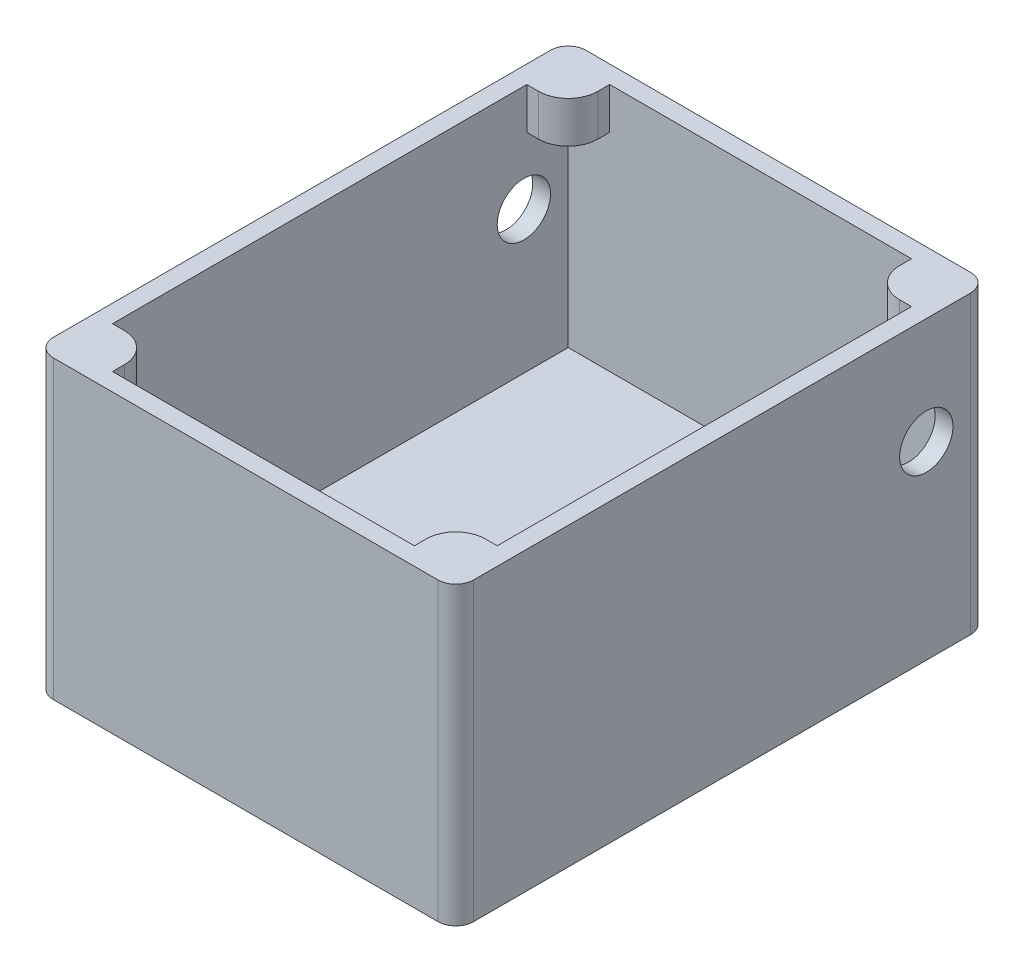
ISO-10303-21;
HEADER;
FILE_DESCRIPTION(('STEP AP214'),'2;1');
FILE_NAME('part.step','',(''),(''),'','','');
FILE_SCHEMA(('AUTOMOTIVE_DESIGN { 1 0 10303 214 1 1 1 1 }'));
ENDSEC;
DATA;
#1=APPLICATION_CONTEXT('core data for automotive mechanical design processes');
#2=APPLICATION_PROTOCOL_DEFINITION('international standard','automotive_design',2000,#1);
#3=PRODUCT_CONTEXT('',#1,'mechanical');
#4=PRODUCT('Part','Part','',(#3));
#5=PRODUCT_RELATED_PRODUCT_CATEGORY('part','',(#4));
#6=PRODUCT_DEFINITION_FORMATION('','',#4);
#7=PRODUCT_DEFINITION_CONTEXT('part definition',#1,'design');
#8=PRODUCT_DEFINITION('design','',#6,#7);
#9=PRODUCT_DEFINITION_SHAPE('','',#8);
#10=(LENGTH_UNIT() NAMED_UNIT(*) SI_UNIT(.MILLI.,.METRE.));
#11=(NAMED_UNIT(*) PLANE_ANGLE_UNIT() SI_UNIT($,.RADIAN.));
#12=(NAMED_UNIT(*) SI_UNIT($,.STERADIAN.) SOLID_ANGLE_UNIT());
#13=UNCERTAINTY_MEASURE_WITH_UNIT(LENGTH_MEASURE(1.E-05),#10,'distance_accuracy_value','');
#14=(GEOMETRIC_REPRESENTATION_CONTEXT(3) GLOBAL_UNCERTAINTY_ASSIGNED_CONTEXT((#13)) GLOBAL_UNIT_ASSIGNED_CONTEXT((#10,
#11,#12)) REPRESENTATION_CONTEXT('',''));
#15=CARTESIAN_POINT('',(0.,0.,0.));
#16=DIRECTION('',(0.,0.,1.));
#17=DIRECTION('',(1.,0.,0.));
#18=AXIS2_PLACEMENT_3D('',#15,#16,#17);
#19=CARTESIAN_POINT('',(1.30383104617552,43.,55.499999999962));
#20=DIRECTION('',(0.,-1.,0.));
#21=DIRECTION('',(0.,0.,-1.));
#22=AXIS2_PLACEMENT_3D('',#19,#20,#21);
#23=CYLINDRICAL_SURFACE('',#22,5.);
#24=DIRECTION('',(0.,-1.,0.));
#25=VECTOR('',#24,1.);
#26=CARTESIAN_POINT('',(-3.69616895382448,43.,55.499999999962));
#27=LINE('',#26,#25);
#28=CARTESIAN_POINT('',(-3.69616895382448,50.,55.499999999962));
#29=VERTEX_POINT('',#28);
#30=CARTESIAN_POINT('',(-3.69616895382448,43.,55.499999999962));
#31=VERTEX_POINT('',#30);
#32=EDGE_CURVE('E459',#29,#31,#27,.T.);
#33=ORIENTED_EDGE('',*,*,#32,.F.);
#34=CARTESIAN_POINT('',(1.30383104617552,50.,55.499999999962));
#35=DIRECTION('',(0.,-1.,0.));
#36=DIRECTION('',(0.,0.,-1.));
#37=AXIS2_PLACEMENT_3D('',#34,#35,#36);
#38=CIRCLE('',#37,5.);
#39=CARTESIAN_POINT('',(1.30383104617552,50.,50.499999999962));
#40=VERTEX_POINT('',#39);
#41=EDGE_CURVE('E40',#40,#29,#38,.F.);
#42=ORIENTED_EDGE('',*,*,#41,.F.);
#43=DIRECTION('',(0.,-1.,0.));
#44=VECTOR('',#43,1.);
#45=CARTESIAN_POINT('',(1.30383104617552,43.,50.499999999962));
#46=LINE('',#45,#44);
#47=CARTESIAN_POINT('',(1.30383104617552,43.,50.499999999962));
#48=VERTEX_POINT('',#47);
#49=EDGE_CURVE('E258',#48,#40,#46,.F.);
#50=ORIENTED_EDGE('',*,*,#49,.F.);
#51=CARTESIAN_POINT('',(1.30383104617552,43.,55.499999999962));
#52=DIRECTION('',(0.,1.,0.));
#53=DIRECTION('',(0.,0.,1.));
#54=AXIS2_PLACEMENT_3D('',#51,#52,#53);
#55=CIRCLE('',#54,5.);
#56=EDGE_CURVE('E11',#31,#48,#55,.F.);
#57=ORIENTED_EDGE('',*,*,#56,.F.);
#58=EDGE_LOOP('',(#33,#42,#50,#57));
#59=FACE_BOUND('',#58,.T.);
#60=ADVANCED_FACE('F33',(#59),#23,.T.);
#61=CARTESIAN_POINT('',(-59.6961689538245,43.,55.499999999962));
#62=DIRECTION('',(0.,1.,0.));
#63=DIRECTION('',(0.,0.,1.));
#64=AXIS2_PLACEMENT_3D('',#61,#62,#63);
#65=CYLINDRICAL_SURFACE('',#64,5.);
#66=DIRECTION('',(0.,1.,0.));
#67=VECTOR('',#66,1.);
#68=CARTESIAN_POINT('',(-54.6961689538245,43.,55.499999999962));
#69=LINE('',#68,#67);
#70=CARTESIAN_POINT('',(-54.6961689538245,43.,55.499999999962));
#71=VERTEX_POINT('',#70);
#72=CARTESIAN_POINT('',(-54.6961689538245,50.,55.499999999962));
#73=VERTEX_POINT('',#72);
#74=EDGE_CURVE('E449',#71,#73,#69,.T.);
#75=ORIENTED_EDGE('',*,*,#74,.F.);
#76=CARTESIAN_POINT('',(-59.6961689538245,43.,55.499999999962));
#77=DIRECTION('',(0.,-1.,0.));
#78=DIRECTION('',(0.,0.,-1.));
#79=AXIS2_PLACEMENT_3D('',#76,#77,#78);
#80=CIRCLE('',#79,5.);
#81=CARTESIAN_POINT('',(-59.6961689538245,43.,50.499999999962));
#82=VERTEX_POINT('',#81);
#83=EDGE_CURVE('E455',#82,#71,#80,.T.);
#84=ORIENTED_EDGE('',*,*,#83,.F.);
#85=DIRECTION('',(0.,1.,0.));
#86=VECTOR('',#85,1.);
#87=CARTESIAN_POINT('',(-59.6961689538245,43.,50.499999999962));
#88=LINE('',#87,#86);
#89=CARTESIAN_POINT('',(-59.6961689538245,50.,50.499999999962));
#90=VERTEX_POINT('',#89);
#91=EDGE_CURVE('E452',#90,#82,#88,.F.);
#92=ORIENTED_EDGE('',*,*,#91,.F.);
#93=CARTESIAN_POINT('',(-59.6961689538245,50.,55.499999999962));
#94=DIRECTION('',(0.,-1.,0.));
#95=DIRECTION('',(0.,0.,-1.));
#96=AXIS2_PLACEMENT_3D('',#93,#94,#95);
#97=CIRCLE('',#96,5.);
#98=EDGE_CURVE('E457',#73,#90,#97,.F.);
#99=ORIENTED_EDGE('',*,*,#98,.F.);
#100=EDGE_LOOP('',(#75,#84,#92,#99));
#101=FACE_BOUND('',#100,.T.);
#102=ADVANCED_FACE('F559',(#101),#65,.T.);
#103=CARTESIAN_POINT('',(1.30383104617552,43.,-24.5));
#104=DIRECTION('',(0.,1.,0.));
#105=DIRECTION('',(0.,0.,1.));
#106=AXIS2_PLACEMENT_3D('',#103,#104,#105);
#107=CYLINDRICAL_SURFACE('',#106,5.);
#108=DIRECTION('',(0.,1.,0.));
#109=VECTOR('',#108,1.);
#110=CARTESIAN_POINT('',(-3.69616895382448,43.,-24.5));
#111=LINE('',#110,#109);
#112=CARTESIAN_POINT('',(-3.69616895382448,43.,-24.5));
#113=VERTEX_POINT('',#112);
#114=CARTESIAN_POINT('',(-3.69616895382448,50.,-24.5));
#115=VERTEX_POINT('',#114);
#116=EDGE_CURVE('E439',#113,#115,#111,.T.);
#117=ORIENTED_EDGE('',*,*,#116,.F.);
#118=CARTESIAN_POINT('',(1.30383104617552,43.,-24.5));
#119=DIRECTION('',(0.,-1.,0.));
#120=DIRECTION('',(0.,0.,-1.));
#121=AXIS2_PLACEMENT_3D('',#118,#119,#120);
#122=CIRCLE('',#121,5.);
#123=CARTESIAN_POINT('',(1.30383104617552,43.,-19.5));
#124=VERTEX_POINT('',#123);
#125=EDGE_CURVE('E445',#124,#113,#122,.T.);
#126=ORIENTED_EDGE('',*,*,#125,.F.);
#127=DIRECTION('',(0.,1.,0.));
#128=VECTOR('',#127,1.);
#129=CARTESIAN_POINT('',(1.30383104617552,43.,-19.5));
#130=LINE('',#129,#128);
#131=CARTESIAN_POINT('',(1.30383104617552,50.,-19.5));
#132=VERTEX_POINT('',#131);
#133=EDGE_CURVE('E442',#132,#124,#130,.F.);
#134=ORIENTED_EDGE('',*,*,#133,.F.);
#135=CARTESIAN_POINT('',(1.30383104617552,50.,-24.5));
#136=DIRECTION('',(0.,-1.,0.));
#137=DIRECTION('',(0.,0.,-1.));
#138=AXIS2_PLACEMENT_3D('',#135,#136,#137);
#139=CIRCLE('',#138,5.);
#140=EDGE_CURVE('E447',#115,#132,#139,.F.);
#141=ORIENTED_EDGE('',*,*,#140,.F.);
#142=EDGE_LOOP('',(#117,#126,#134,#141));
#143=FACE_BOUND('',#142,.T.);
#144=ADVANCED_FACE('F563',(#143),#107,.T.);
#145=CARTESIAN_POINT('',(-59.6961689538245,43.,-24.5));
#146=DIRECTION('',(0.,1.,0.));
#147=DIRECTION('',(0.,0.,1.));
#148=AXIS2_PLACEMENT_3D('',#145,#146,#147);
#149=CYLINDRICAL_SURFACE('',#148,5.);
#150=DIRECTION('',(0.,1.,0.));
#151=VECTOR('',#150,1.);
#152=CARTESIAN_POINT('',(-59.6961689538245,43.,-19.5));
#153=LINE('',#152,#151);
#154=CARTESIAN_POINT('',(-59.6961689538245,43.,-19.5));
#155=VERTEX_POINT('',#154);
#156=CARTESIAN_POINT('',(-59.6961689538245,50.,-19.5));
#157=VERTEX_POINT('',#156);
#158=EDGE_CURVE('E429',#155,#157,#153,.T.);
#159=ORIENTED_EDGE('',*,*,#158,.F.);
#160=CARTESIAN_POINT('',(-59.6961689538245,43.,-24.5));
#161=DIRECTION('',(0.,1.,0.));
#162=DIRECTION('',(0.,0.,1.));
#163=AXIS2_PLACEMENT_3D('',#160,#161,#162);
#164=CIRCLE('',#163,5.);
#165=CARTESIAN_POINT('',(-54.6961689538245,43.,-24.5));
#166=VERTEX_POINT('',#165);
#167=EDGE_CURVE('E435',#166,#155,#164,.F.);
#168=ORIENTED_EDGE('',*,*,#167,.F.);
#169=DIRECTION('',(0.,1.,0.));
#170=VECTOR('',#169,1.);
#171=CARTESIAN_POINT('',(-54.6961689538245,43.,-24.5));
#172=LINE('',#171,#170);
#173=CARTESIAN_POINT('',(-54.6961689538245,50.,-24.5));
#174=VERTEX_POINT('',#173);
#175=EDGE_CURVE('E432',#174,#166,#172,.F.);
#176=ORIENTED_EDGE('',*,*,#175,.F.);
#177=CARTESIAN_POINT('',(-59.6961689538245,50.,-24.5));
#178=DIRECTION('',(0.,-1.,0.));
#179=DIRECTION('',(0.,0.,-1.));
#180=AXIS2_PLACEMENT_3D('',#177,#178,#179);
#181=CIRCLE('',#180,5.);
#182=EDGE_CURVE('E437',#157,#174,#181,.F.);
#183=ORIENTED_EDGE('',*,*,#182,.F.);
#184=EDGE_LOOP('',(#159,#168,#176,#183));
#185=FACE_BOUND('',#184,.T.);
#186=ADVANCED_FACE('F511',(#185),#149,.T.);
#187=CARTESIAN_POINT('',(-61.6961689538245,50.,57.499999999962));
#188=DIRECTION('',(0.,1.,0.));
#189=DIRECTION('',(0.,0.,1.));
#190=AXIS2_PLACEMENT_3D('',#187,#188,#189);
#191=CYLINDRICAL_SURFACE('',#190,3.);
#192=DIRECTION('',(0.,1.,0.));
#193=VECTOR('',#192,1.);
#194=CARTESIAN_POINT('',(-64.6961689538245,50.,57.499999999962));
#195=LINE('',#194,#193);
#196=CARTESIAN_POINT('',(-64.6961689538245,0.,57.499999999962));
#197=VERTEX_POINT('',#196);
#198=CARTESIAN_POINT('',(-64.6961689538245,50.,57.499999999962));
#199=VERTEX_POINT('',#198);
#200=EDGE_CURVE('E419',#197,#199,#195,.T.);
#201=ORIENTED_EDGE('',*,*,#200,.F.);
#202=CARTESIAN_POINT('',(-61.6961689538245,0.,57.499999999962));
#203=DIRECTION('',(0.,-1.,0.));
#204=DIRECTION('',(0.,0.,-1.));
#205=AXIS2_PLACEMENT_3D('',#202,#203,#204);
#206=CIRCLE('',#205,3.);
#207=CARTESIAN_POINT('',(-61.6961689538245,0.,60.499999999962));
#208=VERTEX_POINT('',#207);
#209=EDGE_CURVE('E425',#208,#197,#206,.T.);
#210=ORIENTED_EDGE('',*,*,#209,.F.);
#211=DIRECTION('',(0.,1.,0.));
#212=VECTOR('',#211,1.);
#213=CARTESIAN_POINT('',(-61.6961689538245,50.,60.499999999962));
#214=LINE('',#213,#212);
#215=CARTESIAN_POINT('',(-61.6961689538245,50.,60.499999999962));
#216=VERTEX_POINT('',#215);
#217=EDGE_CURVE('E422',#216,#208,#214,.F.);
#218=ORIENTED_EDGE('',*,*,#217,.F.);
#219=CARTESIAN_POINT('',(-61.6961689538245,50.,57.499999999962));
#220=DIRECTION('',(0.,-1.,0.));
#221=DIRECTION('',(0.,0.,-1.));
#222=AXIS2_PLACEMENT_3D('',#219,#220,#221);
#223=CIRCLE('',#222,3.);
#224=EDGE_CURVE('E427',#199,#216,#223,.F.);
#225=ORIENTED_EDGE('',*,*,#224,.F.);
#226=EDGE_LOOP('',(#201,#210,#218,#225));
#227=FACE_BOUND('',#226,.T.);
#228=ADVANCED_FACE('F573',(#227),#191,.T.);
#229=CARTESIAN_POINT('',(3.30383104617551,50.,57.499999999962));
#230=DIRECTION('',(0.,-1.,0.));
#231=DIRECTION('',(0.,0.,-1.));
#232=AXIS2_PLACEMENT_3D('',#229,#230,#231);
#233=CYLINDRICAL_SURFACE('',#232,3.);
#234=DIRECTION('',(0.,1.,0.));
#235=VECTOR('',#234,1.);
#236=CARTESIAN_POINT('',(3.30383104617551,50.,60.499999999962));
#237=LINE('',#236,#235);
#238=CARTESIAN_POINT('',(3.30383104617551,0.,60.499999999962));
#239=VERTEX_POINT('',#238);
#240=CARTESIAN_POINT('',(3.30383104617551,50.,60.499999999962));
#241=VERTEX_POINT('',#240);
#242=EDGE_CURVE('E408',#239,#241,#237,.T.);
#243=ORIENTED_EDGE('',*,*,#242,.F.);
#244=CARTESIAN_POINT('',(3.30383104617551,0.,57.499999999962));
#245=DIRECTION('',(0.,-1.,0.));
#246=DIRECTION('',(0.,0.,-1.));
#247=AXIS2_PLACEMENT_3D('',#244,#245,#246);
#248=CIRCLE('',#247,3.);
#249=CARTESIAN_POINT('',(6.30383104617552,0.,57.499999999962));
#250=VERTEX_POINT('',#249);
#251=EDGE_CURVE('E414',#250,#239,#248,.T.);
#252=ORIENTED_EDGE('',*,*,#251,.F.);
#253=DIRECTION('',(0.,1.,0.));
#254=VECTOR('',#253,1.);
#255=CARTESIAN_POINT('',(6.30383104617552,50.,57.499999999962));
#256=LINE('',#255,#254);
#257=CARTESIAN_POINT('',(6.30383104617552,50.,57.499999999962));
#258=VERTEX_POINT('',#257);
#259=EDGE_CURVE('E411',#258,#250,#256,.F.);
#260=ORIENTED_EDGE('',*,*,#259,.F.);
#261=CARTESIAN_POINT('',(3.30383104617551,50.,57.499999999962));
#262=DIRECTION('',(0.,-1.,0.));
#263=DIRECTION('',(0.,0.,-1.));
#264=AXIS2_PLACEMENT_3D('',#261,#262,#263);
#265=CIRCLE('',#264,3.);
#266=EDGE_CURVE('E417',#241,#258,#265,.F.);
#267=ORIENTED_EDGE('',*,*,#266,.F.);
#268=EDGE_LOOP('',(#243,#252,#260,#267));
#269=FACE_BOUND('',#268,.T.);
#270=ADVANCED_FACE('F576',(#269),#233,.T.);
#271=CARTESIAN_POINT('',(3.30383104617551,50.,-26.5));
#272=DIRECTION('',(0.,1.,0.));
#273=DIRECTION('',(0.,0.,1.));
#274=AXIS2_PLACEMENT_3D('',#271,#272,#273);
#275=CYLINDRICAL_SURFACE('',#274,3.);
#276=DIRECTION('',(0.,1.,0.));
#277=VECTOR('',#276,1.);
#278=CARTESIAN_POINT('',(6.30383104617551,50.,-26.5));
#279=LINE('',#278,#277);
#280=CARTESIAN_POINT('',(6.30383104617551,0.,-26.5));
#281=VERTEX_POINT('',#280);
#282=CARTESIAN_POINT('',(6.30383104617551,50.,-26.5));
#283=VERTEX_POINT('',#282);
#284=EDGE_CURVE('E398',#281,#283,#279,.T.);
#285=ORIENTED_EDGE('',*,*,#284,.F.);
#286=CARTESIAN_POINT('',(3.30383104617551,0.,-26.5));
#287=DIRECTION('',(0.,-1.,0.));
#288=DIRECTION('',(0.,0.,-1.));
#289=AXIS2_PLACEMENT_3D('',#286,#287,#288);
#290=CIRCLE('',#289,3.);
#291=CARTESIAN_POINT('',(3.30383104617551,0.,-29.5));
#292=VERTEX_POINT('',#291);
#293=EDGE_CURVE('E404',#292,#281,#290,.T.);
#294=ORIENTED_EDGE('',*,*,#293,.F.);
#295=DIRECTION('',(0.,1.,0.));
#296=VECTOR('',#295,1.);
#297=CARTESIAN_POINT('',(3.30383104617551,50.,-29.5));
#298=LINE('',#297,#296);
#299=CARTESIAN_POINT('',(3.30383104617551,50.,-29.5));
#300=VERTEX_POINT('',#299);
#301=EDGE_CURVE('E401',#300,#292,#298,.F.);
#302=ORIENTED_EDGE('',*,*,#301,.F.);
#303=CARTESIAN_POINT('',(3.30383104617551,50.,-26.5));
#304=DIRECTION('',(0.,-1.,0.));
#305=DIRECTION('',(0.,0.,-1.));
#306=AXIS2_PLACEMENT_3D('',#303,#304,#305);
#307=CIRCLE('',#306,3.);
#308=EDGE_CURVE('E406',#283,#300,#307,.F.);
#309=ORIENTED_EDGE('',*,*,#308,.F.);
#310=EDGE_LOOP('',(#285,#294,#302,#309));
#311=FACE_BOUND('',#310,.T.);
#312=ADVANCED_FACE('F580',(#311),#275,.T.);
#313=CARTESIAN_POINT('',(-61.6961689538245,50.,-26.5));
#314=DIRECTION('',(0.,1.,0.));
#315=DIRECTION('',(0.,0.,1.));
#316=AXIS2_PLACEMENT_3D('',#313,#314,#315);
#317=CYLINDRICAL_SURFACE('',#316,3.);
#318=DIRECTION('',(0.,-1.,0.));
#319=VECTOR('',#318,1.);
#320=CARTESIAN_POINT('',(-64.6961689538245,50.,-26.5));
#321=LINE('',#320,#319);
#322=CARTESIAN_POINT('',(-64.6961689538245,50.,-26.5));
#323=VERTEX_POINT('',#322);
#324=CARTESIAN_POINT('',(-64.6961689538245,0.,-26.5));
#325=VERTEX_POINT('',#324);
#326=EDGE_CURVE('E388',#323,#325,#321,.T.);
#327=ORIENTED_EDGE('',*,*,#326,.F.);
#328=CARTESIAN_POINT('',(-61.6961689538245,50.,-26.5));
#329=DIRECTION('',(0.,-1.,0.));
#330=DIRECTION('',(0.,0.,-1.));
#331=AXIS2_PLACEMENT_3D('',#328,#329,#330);
#332=CIRCLE('',#331,3.);
#333=CARTESIAN_POINT('',(-61.6961689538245,50.,-29.5));
#334=VERTEX_POINT('',#333);
#335=EDGE_CURVE('E394',#334,#323,#332,.F.);
#336=ORIENTED_EDGE('',*,*,#335,.F.);
#337=DIRECTION('',(0.,-1.,0.));
#338=VECTOR('',#337,1.);
#339=CARTESIAN_POINT('',(-61.6961689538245,50.,-29.5));
#340=LINE('',#339,#338);
#341=CARTESIAN_POINT('',(-61.6961689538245,0.,-29.5));
#342=VERTEX_POINT('',#341);
#343=EDGE_CURVE('E391',#342,#334,#340,.F.);
#344=ORIENTED_EDGE('',*,*,#343,.F.);
#345=CARTESIAN_POINT('',(-61.6961689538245,0.,-26.5));
#346=DIRECTION('',(0.,-1.,0.));
#347=DIRECTION('',(0.,0.,-1.));
#348=AXIS2_PLACEMENT_3D('',#345,#346,#347);
#349=CIRCLE('',#348,3.);
#350=EDGE_CURVE('E396',#325,#342,#349,.T.);
#351=ORIENTED_EDGE('',*,*,#350,.F.);
#352=EDGE_LOOP('',(#327,#336,#344,#351));
#353=FACE_BOUND('',#352,.T.);
#354=ADVANCED_FACE('F584',(#353),#317,.T.);
#355=CARTESIAN_POINT('',(-61.6961689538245,3.,-26.5));
#356=DIRECTION('',(-1.,0.,0.));
#357=DIRECTION('',(0.,0.,1.));
#358=AXIS2_PLACEMENT_3D('',#355,#356,#357);
#359=PLANE('',#358);
#360=CARTESIAN_POINT('',(-61.6961689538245,32.,-19.));
#361=DIRECTION('',(-1.,0.,0.));
#362=DIRECTION('',(0.,0.,1.));
#363=AXIS2_PLACEMENT_3D('',#360,#361,#362);
#364=CIRCLE('',#363,4.5);
#365=CARTESIAN_POINT('',(-61.6961689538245,32.,-14.5));
#366=VERTEX_POINT('',#365);
#367=EDGE_CURVE('E295',#366,#366,#364,.T.);
#368=ORIENTED_EDGE('',*,*,#367,.T.);
#369=EDGE_LOOP('',(#368));
#370=FACE_BOUND('',#369,.T.);
#371=DIRECTION('',(0.,0.,-1.));
#372=VECTOR('',#371,1.);
#373=CARTESIAN_POINT('',(-61.6961689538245,43.,-26.5));
#374=LINE('',#373,#372);
#375=CARTESIAN_POINT('',(-61.6961689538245,43.,-19.5));
#376=VERTEX_POINT('',#375);
#377=CARTESIAN_POINT('',(-61.6961689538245,43.,-26.5));
#378=VERTEX_POINT('',#377);
#379=EDGE_CURVE('E477',#376,#378,#374,.T.);
#380=ORIENTED_EDGE('',*,*,#379,.F.);
#381=DIRECTION('',(0.,1.,0.));
#382=VECTOR('',#381,1.);
#383=CARTESIAN_POINT('',(-61.6961689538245,3.,-19.5));
#384=LINE('',#383,#382);
#385=CARTESIAN_POINT('',(-61.6961689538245,50.,-19.5));
#386=VERTEX_POINT('',#385);
#387=EDGE_CURVE('E489',#376,#386,#384,.T.);
#388=ORIENTED_EDGE('',*,*,#387,.T.);
#389=DIRECTION('',(0.,0.,1.));
#390=VECTOR('',#389,1.);
#391=CARTESIAN_POINT('',(-61.6961689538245,50.,-26.5));
#392=LINE('',#391,#390);
#393=CARTESIAN_POINT('',(-61.6961689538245,50.,50.499999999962));
#394=VERTEX_POINT('',#393);
#395=EDGE_CURVE('E328',#386,#394,#392,.T.);
#396=ORIENTED_EDGE('',*,*,#395,.T.);
#397=DIRECTION('',(0.,-1.,0.));
#398=VECTOR('',#397,1.);
#399=CARTESIAN_POINT('',(-61.6961689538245,3.,50.499999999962));
#400=LINE('',#399,#398);
#401=CARTESIAN_POINT('',(-61.6961689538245,43.,50.499999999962));
#402=VERTEX_POINT('',#401);
#403=EDGE_CURVE('E285',#394,#402,#400,.T.);
#404=ORIENTED_EDGE('',*,*,#403,.T.);
#405=DIRECTION('',(0.,0.,1.));
#406=VECTOR('',#405,1.);
#407=CARTESIAN_POINT('',(-61.6961689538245,43.,-26.5));
#408=LINE('',#407,#406);
#409=CARTESIAN_POINT('',(-61.6961689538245,43.,57.4999999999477));
#410=VERTEX_POINT('',#409);
#411=EDGE_CURVE('E280',#402,#410,#408,.T.);
#412=ORIENTED_EDGE('',*,*,#411,.T.);
#413=DIRECTION('',(0.,1.,0.));
#414=VECTOR('',#413,1.);
#415=CARTESIAN_POINT('',(-61.6961689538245,3.,57.4999999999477));
#416=LINE('',#415,#414);
#417=CARTESIAN_POINT('',(-61.6961689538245,3.,57.4999999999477));
#418=VERTEX_POINT('',#417);
#419=EDGE_CURVE('E342',#418,#410,#416,.T.);
#420=ORIENTED_EDGE('',*,*,#419,.F.);
#421=DIRECTION('',(0.,0.,1.));
#422=VECTOR('',#421,1.);
#423=CARTESIAN_POINT('',(-61.6961689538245,3.,-26.5));
#424=LINE('',#423,#422);
#425=CARTESIAN_POINT('',(-61.6961689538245,3.,36.));
#426=VERTEX_POINT('',#425);
#427=EDGE_CURVE('E333',#426,#418,#424,.T.);
#428=ORIENTED_EDGE('',*,*,#427,.F.);
#429=DIRECTION('',(0.,-1.,0.));
#430=VECTOR('',#429,1.);
#431=CARTESIAN_POINT('',(-61.6961689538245,8.,36.));
#432=LINE('',#431,#430);
#433=CARTESIAN_POINT('',(-61.6961689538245,8.,36.));
#434=VERTEX_POINT('',#433);
#435=EDGE_CURVE('E321',#434,#426,#432,.T.);
#436=ORIENTED_EDGE('',*,*,#435,.F.);
#437=DIRECTION('',(0.,0.,1.));
#438=VECTOR('',#437,1.);
#439=CARTESIAN_POINT('',(-61.6961689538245,8.,-26.5));
#440=LINE('',#439,#438);
#441=CARTESIAN_POINT('',(-61.6961689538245,8.,-26.5));
#442=VERTEX_POINT('',#441);
#443=EDGE_CURVE('E299',#442,#434,#440,.T.);
#444=ORIENTED_EDGE('',*,*,#443,.F.);
#445=DIRECTION('',(0.,1.,0.));
#446=VECTOR('',#445,1.);
#447=CARTESIAN_POINT('',(-61.6961689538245,3.,-26.5));
#448=LINE('',#447,#446);
#449=EDGE_CURVE('E346',#442,#378,#448,.T.);
#450=ORIENTED_EDGE('',*,*,#449,.T.);
#451=EDGE_LOOP('',(#380,#388,#396,#404,#412,#420,#428,#436,#444,#450));
#452=FACE_BOUND('',#451,.T.);
#453=ADVANCED_FACE('F518',(#370,#452),#359,.F.);
#454=CARTESIAN_POINT('',(-61.6961689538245,3.,-26.5));
#455=DIRECTION('',(0.,0.,-1.));
#456=DIRECTION('',(-1.,0.,0.));
#457=AXIS2_PLACEMENT_3D('',#454,#455,#456);
#458=PLANE('',#457);
#459=DIRECTION('',(-1.,0.,0.));
#460=VECTOR('',#459,1.);
#461=CARTESIAN_POINT('',(-61.6961689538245,50.,-26.5));
#462=LINE('',#461,#460);
#463=CARTESIAN_POINT('',(-3.69616895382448,50.,-26.5));
#464=VERTEX_POINT('',#463);
#465=CARTESIAN_POINT('',(-54.6961689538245,50.,-26.5));
#466=VERTEX_POINT('',#465);
#467=EDGE_CURVE('E244',#464,#466,#462,.T.);
#468=ORIENTED_EDGE('',*,*,#467,.T.);
#469=DIRECTION('',(0.,-1.,0.));
#470=VECTOR('',#469,1.);
#471=CARTESIAN_POINT('',(-54.6961689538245,3.,-26.5));
#472=LINE('',#471,#470);
#473=CARTESIAN_POINT('',(-54.6961689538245,43.,-26.5));
#474=VERTEX_POINT('',#473);
#475=EDGE_CURVE('E486',#466,#474,#472,.T.);
#476=ORIENTED_EDGE('',*,*,#475,.T.);
#477=DIRECTION('',(1.,0.,0.));
#478=VECTOR('',#477,1.);
#479=CARTESIAN_POINT('',(-61.6961689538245,43.,-26.5));
#480=LINE('',#479,#478);
#481=EDGE_CURVE('E483',#378,#474,#480,.T.);
#482=ORIENTED_EDGE('',*,*,#481,.F.);
#483=ORIENTED_EDGE('',*,*,#449,.F.);
#484=DIRECTION('',(-1.,0.,0.));
#485=VECTOR('',#484,1.);
#486=CARTESIAN_POINT('',(-61.6961689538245,8.,-26.5));
#487=LINE('',#486,#485);
#488=CARTESIAN_POINT('',(-10.6961689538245,8.,-26.5));
#489=VERTEX_POINT('',#488);
#490=EDGE_CURVE('E308',#489,#442,#487,.T.);
#491=ORIENTED_EDGE('',*,*,#490,.F.);
#492=DIRECTION('',(0.,-1.,0.));
#493=VECTOR('',#492,1.);
#494=CARTESIAN_POINT('',(-10.6961689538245,8.,-26.5));
#495=LINE('',#494,#493);
#496=CARTESIAN_POINT('',(-10.6961689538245,3.,-26.5));
#497=VERTEX_POINT('',#496);
#498=EDGE_CURVE('E311',#489,#497,#495,.T.);
#499=ORIENTED_EDGE('',*,*,#498,.T.);
#500=DIRECTION('',(-1.,0.,0.));
#501=VECTOR('',#500,1.);
#502=CARTESIAN_POINT('',(-61.6961689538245,3.,-26.5));
#503=LINE('',#502,#501);
#504=CARTESIAN_POINT('',(3.30383104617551,3.,-26.5));
#505=VERTEX_POINT('',#504);
#506=EDGE_CURVE('E331',#505,#497,#503,.T.);
#507=ORIENTED_EDGE('',*,*,#506,.F.);
#508=DIRECTION('',(0.,1.,0.));
#509=VECTOR('',#508,1.);
#510=CARTESIAN_POINT('',(3.30383104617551,3.,-26.5));
#511=LINE('',#510,#509);
#512=CARTESIAN_POINT('',(3.30383104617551,43.,-26.5));
#513=VERTEX_POINT('',#512);
#514=EDGE_CURVE('E349',#505,#513,#511,.T.);
#515=ORIENTED_EDGE('',*,*,#514,.T.);
#516=DIRECTION('',(-1.,0.,0.));
#517=VECTOR('',#516,1.);
#518=CARTESIAN_POINT('',(-61.6961689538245,43.,-26.5));
#519=LINE('',#518,#517);
#520=CARTESIAN_POINT('',(-3.69616895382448,43.,-26.5));
#521=VERTEX_POINT('',#520);
#522=EDGE_CURVE('E264',#513,#521,#519,.T.);
#523=ORIENTED_EDGE('',*,*,#522,.T.);
#524=DIRECTION('',(0.,1.,0.));
#525=VECTOR('',#524,1.);
#526=CARTESIAN_POINT('',(-3.69616895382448,3.,-26.5));
#527=LINE('',#526,#525);
#528=EDGE_CURVE('E260',#521,#464,#527,.T.);
#529=ORIENTED_EDGE('',*,*,#528,.T.);
#530=EDGE_LOOP('',(#468,#476,#482,#483,#491,#499,#507,#515,#523,#529));
#531=FACE_BOUND('',#530,.T.);
#532=ADVANCED_FACE('F545',(#531),#458,.F.);
#533=CARTESIAN_POINT('',(0.,3.,0.));
#534=DIRECTION('',(0.,-1.,0.));
#535=DIRECTION('',(0.,0.,-1.));
#536=AXIS2_PLACEMENT_3D('',#533,#534,#535);
#537=PLANE('',#536);
#538=DIRECTION('',(1.,0.,0.));
#539=VECTOR('',#538,1.);
#540=CARTESIAN_POINT('',(-61.6961689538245,3.,36.));
#541=LINE('',#540,#539);
#542=CARTESIAN_POINT('',(-10.6961689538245,3.,36.));
#543=VERTEX_POINT('',#542);
#544=EDGE_CURVE('E298',#426,#543,#541,.T.);
#545=ORIENTED_EDGE('',*,*,#544,.F.);
#546=ORIENTED_EDGE('',*,*,#427,.T.);
#547=DIRECTION('',(1.,0.,0.));
#548=VECTOR('',#547,1.);
#549=CARTESIAN_POINT('',(-61.6961689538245,3.,57.4999999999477));
#550=LINE('',#549,#548);
#551=CARTESIAN_POINT('',(3.30383104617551,3.,57.4999999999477));
#552=VERTEX_POINT('',#551);
#553=EDGE_CURVE('E324',#418,#552,#550,.T.);
#554=ORIENTED_EDGE('',*,*,#553,.T.);
#555=DIRECTION('',(0.,0.,-1.));
#556=VECTOR('',#555,1.);
#557=CARTESIAN_POINT('',(3.30383104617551,3.,-26.5));
#558=LINE('',#557,#556);
#559=EDGE_CURVE('E327',#552,#505,#558,.T.);
#560=ORIENTED_EDGE('',*,*,#559,.T.);
#561=ORIENTED_EDGE('',*,*,#506,.T.);
#562=DIRECTION('',(0.,0.,-1.));
#563=VECTOR('',#562,1.);
#564=CARTESIAN_POINT('',(-10.6961689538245,3.,-26.5));
#565=LINE('',#564,#563);
#566=EDGE_CURVE('E303',#543,#497,#565,.T.);
#567=ORIENTED_EDGE('',*,*,#566,.F.);
#568=EDGE_LOOP('',(#545,#546,#554,#560,#561,#567));
#569=FACE_BOUND('',#568,.T.);
#570=ADVANCED_FACE('F535',(#569),#537,.F.);
#571=CARTESIAN_POINT('',(-64.6961689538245,50.,-29.5));
#572=DIRECTION('',(0.,0.,-1.));
#573=DIRECTION('',(-1.,0.,0.));
#574=AXIS2_PLACEMENT_3D('',#571,#572,#573);
#575=PLANE('',#574);
#576=DIRECTION('',(1.,0.,0.));
#577=VECTOR('',#576,1.);
#578=CARTESIAN_POINT('',(-64.6961689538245,50.,-29.5));
#579=LINE('',#578,#577);
#580=EDGE_CURVE('E353',#334,#300,#579,.T.);
#581=ORIENTED_EDGE('',*,*,#580,.T.);
#582=ORIENTED_EDGE('',*,*,#301,.T.);
#583=DIRECTION('',(1.,0.,0.));
#584=VECTOR('',#583,1.);
#585=CARTESIAN_POINT('',(-64.6961689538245,0.,-29.5));
#586=LINE('',#585,#584);
#587=EDGE_CURVE('E345',#342,#292,#586,.T.);
#588=ORIENTED_EDGE('',*,*,#587,.F.);
#589=ORIENTED_EDGE('',*,*,#343,.T.);
#590=EDGE_LOOP('',(#581,#582,#588,#589));
#591=FACE_BOUND('',#590,.T.);
#592=ADVANCED_FACE('F589',(#591),#575,.T.);
#593=CARTESIAN_POINT('',(-64.6961689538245,50.,-29.5));
#594=DIRECTION('',(1.,0.,0.));
#595=DIRECTION('',(0.,0.,-1.));
#596=AXIS2_PLACEMENT_3D('',#593,#594,#595);
#597=PLANE('',#596);
#598=DIRECTION('',(0.,0.,1.));
#599=VECTOR('',#598,1.);
#600=CARTESIAN_POINT('',(-64.6961689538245,0.,-29.5));
#601=LINE('',#600,#599);
#602=EDGE_CURVE('E357',#325,#197,#601,.T.);
#603=ORIENTED_EDGE('',*,*,#602,.T.);
#604=ORIENTED_EDGE('',*,*,#200,.T.);
#605=DIRECTION('',(0.,0.,1.));
#606=VECTOR('',#605,1.);
#607=CARTESIAN_POINT('',(-64.6961689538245,50.,-29.5));
#608=LINE('',#607,#606);
#609=EDGE_CURVE('E362',#323,#199,#608,.T.);
#610=ORIENTED_EDGE('',*,*,#609,.F.);
#611=ORIENTED_EDGE('',*,*,#326,.T.);
#612=EDGE_LOOP('',(#603,#604,#610,#611));
#613=FACE_BOUND('',#612,.T.);
#614=CARTESIAN_POINT('',(-64.6961689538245,32.,-19.));
#615=DIRECTION('',(1.,0.,0.));
#616=DIRECTION('',(0.,0.,-1.));
#617=AXIS2_PLACEMENT_3D('',#614,#615,#616);
#618=CIRCLE('',#617,4.5);
#619=CARTESIAN_POINT('',(-64.6961689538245,32.,-23.5));
#620=VERTEX_POINT('',#619);
#621=EDGE_CURVE('E291',#620,#620,#618,.T.);
#622=ORIENTED_EDGE('',*,*,#621,.T.);
#623=EDGE_LOOP('',(#622));
#624=FACE_BOUND('',#623,.T.);
#625=ADVANCED_FACE('F592',(#613,#624),#597,.F.);
#626=CARTESIAN_POINT('',(-64.6961689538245,50.,60.499999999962));
#627=DIRECTION('',(0.,0.,-1.));
#628=DIRECTION('',(-1.,0.,0.));
#629=AXIS2_PLACEMENT_3D('',#626,#627,#628);
#630=PLANE('',#629);
#631=DIRECTION('',(1.,0.,0.));
#632=VECTOR('',#631,1.);
#633=CARTESIAN_POINT('',(-64.6961689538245,50.,60.499999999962));
#634=LINE('',#633,#632);
#635=EDGE_CURVE('E360',#216,#241,#634,.T.);
#636=ORIENTED_EDGE('',*,*,#635,.F.);
#637=ORIENTED_EDGE('',*,*,#217,.T.);
#638=DIRECTION('',(1.,0.,0.));
#639=VECTOR('',#638,1.);
#640=CARTESIAN_POINT('',(-64.6961689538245,0.,60.499999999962));
#641=LINE('',#640,#639);
#642=EDGE_CURVE('E371',#208,#239,#641,.T.);
#643=ORIENTED_EDGE('',*,*,#642,.T.);
#644=ORIENTED_EDGE('',*,*,#242,.T.);
#645=EDGE_LOOP('',(#636,#637,#643,#644));
#646=FACE_BOUND('',#645,.T.);
#647=ADVANCED_FACE('F597',(#646),#630,.F.);
#648=CARTESIAN_POINT('',(6.30383104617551,50.,-29.5));
#649=DIRECTION('',(1.,0.,0.));
#650=DIRECTION('',(0.,0.,-1.));
#651=AXIS2_PLACEMENT_3D('',#648,#649,#650);
#652=PLANE('',#651);
#653=DIRECTION('',(0.,0.,1.));
#654=VECTOR('',#653,1.);
#655=CARTESIAN_POINT('',(6.30383104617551,50.,-29.5));
#656=LINE('',#655,#654);
#657=EDGE_CURVE('E356',#283,#258,#656,.T.);
#658=ORIENTED_EDGE('',*,*,#657,.T.);
#659=ORIENTED_EDGE('',*,*,#259,.T.);
#660=DIRECTION('',(0.,0.,1.));
#661=VECTOR('',#660,1.);
#662=CARTESIAN_POINT('',(6.30383104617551,0.,-29.5));
#663=LINE('',#662,#661);
#664=EDGE_CURVE('E368',#281,#250,#663,.T.);
#665=ORIENTED_EDGE('',*,*,#664,.F.);
#666=ORIENTED_EDGE('',*,*,#284,.T.);
#667=EDGE_LOOP('',(#658,#659,#665,#666));
#668=FACE_BOUND('',#667,.T.);
#669=CARTESIAN_POINT('',(6.30383104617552,32.,-19.));
#670=DIRECTION('',(1.,0.,0.));
#671=DIRECTION('',(0.,0.,-1.));
#672=AXIS2_PLACEMENT_3D('',#669,#670,#671);
#673=CIRCLE('',#672,4.5);
#674=CARTESIAN_POINT('',(6.30383104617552,32.,-23.5));
#675=VERTEX_POINT('',#674);
#676=EDGE_CURVE('E288',#675,#675,#673,.T.);
#677=ORIENTED_EDGE('',*,*,#676,.F.);
#678=EDGE_LOOP('',(#677));
#679=FACE_BOUND('',#678,.T.);
#680=ADVANCED_FACE('F594',(#668,#679),#652,.T.);
#681=CARTESIAN_POINT('',(0.,50.,0.));
#682=DIRECTION('',(0.,-1.,0.));
#683=DIRECTION('',(0.,0.,-1.));
#684=AXIS2_PLACEMENT_3D('',#681,#682,#683);
#685=PLANE('',#684);
#686=DIRECTION('',(-1.,0.,0.));
#687=VECTOR('',#686,1.);
#688=CARTESIAN_POINT('',(6.30383104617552,50.,50.499999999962));
#689=LINE('',#688,#687);
#690=CARTESIAN_POINT('',(3.30383104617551,50.,50.499999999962));
#691=VERTEX_POINT('',#690);
#692=EDGE_CURVE('E238',#691,#40,#689,.T.);
#693=ORIENTED_EDGE('',*,*,#692,.T.);
#694=ORIENTED_EDGE('',*,*,#41,.T.);
#695=DIRECTION('',(0.,0.,1.));
#696=VECTOR('',#695,1.);
#697=CARTESIAN_POINT('',(-3.69616895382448,50.,60.499999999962));
#698=LINE('',#697,#696);
#699=CARTESIAN_POINT('',(-3.69616895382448,50.,57.4999999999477));
#700=VERTEX_POINT('',#699);
#701=EDGE_CURVE('E259',#29,#700,#698,.T.);
#702=ORIENTED_EDGE('',*,*,#701,.T.);
#703=DIRECTION('',(1.,0.,0.));
#704=VECTOR('',#703,1.);
#705=CARTESIAN_POINT('',(-61.6961689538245,50.,57.4999999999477));
#706=LINE('',#705,#704);
#707=CARTESIAN_POINT('',(-54.6961689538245,50.,57.4999999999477));
#708=VERTEX_POINT('',#707);
#709=EDGE_CURVE('E245',#708,#700,#706,.T.);
#710=ORIENTED_EDGE('',*,*,#709,.F.);
#711=DIRECTION('',(0.,0.,-1.));
#712=VECTOR('',#711,1.);
#713=CARTESIAN_POINT('',(-54.6961689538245,50.,60.499999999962));
#714=LINE('',#713,#712);
#715=EDGE_CURVE('E273',#708,#73,#714,.T.);
#716=ORIENTED_EDGE('',*,*,#715,.T.);
#717=ORIENTED_EDGE('',*,*,#98,.T.);
#718=DIRECTION('',(-1.,0.,0.));
#719=VECTOR('',#718,1.);
#720=CARTESIAN_POINT('',(-64.6961689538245,50.,50.499999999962));
#721=LINE('',#720,#719);
#722=EDGE_CURVE('E278',#90,#394,#721,.T.);
#723=ORIENTED_EDGE('',*,*,#722,.T.);
#724=ORIENTED_EDGE('',*,*,#395,.F.);
#725=DIRECTION('',(1.,0.,0.));
#726=VECTOR('',#725,1.);
#727=CARTESIAN_POINT('',(-64.6961689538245,50.,-19.5));
#728=LINE('',#727,#726);
#729=EDGE_CURVE('E495',#386,#157,#728,.T.);
#730=ORIENTED_EDGE('',*,*,#729,.T.);
#731=ORIENTED_EDGE('',*,*,#182,.T.);
#732=DIRECTION('',(0.,0.,-1.));
#733=VECTOR('',#732,1.);
#734=CARTESIAN_POINT('',(-54.6961689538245,50.,-29.5));
#735=LINE('',#734,#733);
#736=EDGE_CURVE('E492',#174,#466,#735,.T.);
#737=ORIENTED_EDGE('',*,*,#736,.T.);
#738=ORIENTED_EDGE('',*,*,#467,.F.);
#739=DIRECTION('',(0.,0.,1.));
#740=VECTOR('',#739,1.);
#741=CARTESIAN_POINT('',(-3.69616895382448,50.,-29.5));
#742=LINE('',#741,#740);
#743=EDGE_CURVE('E474',#464,#115,#742,.T.);
#744=ORIENTED_EDGE('',*,*,#743,.T.);
#745=ORIENTED_EDGE('',*,*,#140,.T.);
#746=DIRECTION('',(1.,0.,0.));
#747=VECTOR('',#746,1.);
#748=CARTESIAN_POINT('',(6.30383104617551,50.,-19.5));
#749=LINE('',#748,#747);
#750=CARTESIAN_POINT('',(3.30383104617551,50.,-19.5));
#751=VERTEX_POINT('',#750);
#752=EDGE_CURVE('E240',#132,#751,#749,.T.);
#753=ORIENTED_EDGE('',*,*,#752,.T.);
#754=DIRECTION('',(0.,0.,-1.));
#755=VECTOR('',#754,1.);
#756=CARTESIAN_POINT('',(3.30383104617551,50.,-26.5));
#757=LINE('',#756,#755);
#758=EDGE_CURVE('E233',#691,#751,#757,.T.);
#759=ORIENTED_EDGE('',*,*,#758,.F.);
#760=EDGE_LOOP('',(#693,#694,#702,#710,#716,#717,#723,#724,#730,#731,#737,#738,#744,#745,#753,#759));
#761=FACE_BOUND('',#760,.T.);
#762=ORIENTED_EDGE('',*,*,#609,.T.);
#763=ORIENTED_EDGE('',*,*,#224,.T.);
#764=ORIENTED_EDGE('',*,*,#635,.T.);
#765=ORIENTED_EDGE('',*,*,#266,.T.);
#766=ORIENTED_EDGE('',*,*,#657,.F.);
#767=ORIENTED_EDGE('',*,*,#308,.T.);
#768=ORIENTED_EDGE('',*,*,#580,.F.);
#769=ORIENTED_EDGE('',*,*,#335,.T.);
#770=EDGE_LOOP('',(#762,#763,#764,#765,#766,#767,#768,#769));
#771=FACE_BOUND('',#770,.T.);
#772=ADVANCED_FACE('F235',(#761,#771),#685,.F.);
#773=CARTESIAN_POINT('',(0.,0.,0.));
#774=DIRECTION('',(0.,-1.,0.));
#775=DIRECTION('',(0.,0.,-1.));
#776=AXIS2_PLACEMENT_3D('',#773,#774,#775);
#777=PLANE('',#776);
#778=ORIENTED_EDGE('',*,*,#642,.F.);
#779=ORIENTED_EDGE('',*,*,#209,.T.);
#780=ORIENTED_EDGE('',*,*,#602,.F.);
#781=ORIENTED_EDGE('',*,*,#350,.T.);
#782=ORIENTED_EDGE('',*,*,#587,.T.);
#783=ORIENTED_EDGE('',*,*,#293,.T.);
#784=ORIENTED_EDGE('',*,*,#664,.T.);
#785=ORIENTED_EDGE('',*,*,#251,.T.);
#786=EDGE_LOOP('',(#778,#779,#780,#781,#782,#783,#784,#785));
#787=FACE_BOUND('',#786,.T.);
#788=ADVANCED_FACE('F605',(#787),#777,.T.);
#789=CARTESIAN_POINT('',(-61.6961689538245,3.,57.4999999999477));
#790=DIRECTION('',(0.,0.,1.));
#791=DIRECTION('',(1.,0.,0.));
#792=AXIS2_PLACEMENT_3D('',#789,#790,#791);
#793=PLANE('',#792);
#794=ORIENTED_EDGE('',*,*,#709,.T.);
#795=DIRECTION('',(0.,-1.,0.));
#796=VECTOR('',#795,1.);
#797=CARTESIAN_POINT('',(-3.69616895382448,3.,57.4999999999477));
#798=LINE('',#797,#796);
#799=CARTESIAN_POINT('',(-3.69616895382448,43.,57.4999999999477));
#800=VERTEX_POINT('',#799);
#801=EDGE_CURVE('E255',#700,#800,#798,.T.);
#802=ORIENTED_EDGE('',*,*,#801,.T.);
#803=DIRECTION('',(-1.,0.,0.));
#804=VECTOR('',#803,1.);
#805=CARTESIAN_POINT('',(-61.6961689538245,43.,57.4999999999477));
#806=LINE('',#805,#804);
#807=CARTESIAN_POINT('',(3.30383104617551,43.,57.4999999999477));
#808=VERTEX_POINT('',#807);
#809=EDGE_CURVE('E270',#808,#800,#806,.T.);
#810=ORIENTED_EDGE('',*,*,#809,.F.);
#811=DIRECTION('',(0.,1.,0.));
#812=VECTOR('',#811,1.);
#813=CARTESIAN_POINT('',(3.30383104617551,3.,57.4999999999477));
#814=LINE('',#813,#812);
#815=EDGE_CURVE('E335',#552,#808,#814,.T.);
#816=ORIENTED_EDGE('',*,*,#815,.F.);
#817=ORIENTED_EDGE('',*,*,#553,.F.);
#818=ORIENTED_EDGE('',*,*,#419,.T.);
#819=DIRECTION('',(1.,0.,0.));
#820=VECTOR('',#819,1.);
#821=CARTESIAN_POINT('',(-61.6961689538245,43.,57.4999999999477));
#822=LINE('',#821,#820);
#823=CARTESIAN_POINT('',(-54.6961689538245,43.,57.4999999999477));
#824=VERTEX_POINT('',#823);
#825=EDGE_CURVE('E365',#410,#824,#822,.T.);
#826=ORIENTED_EDGE('',*,*,#825,.T.);
#827=DIRECTION('',(0.,1.,0.));
#828=VECTOR('',#827,1.);
#829=CARTESIAN_POINT('',(-54.6961689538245,3.,57.4999999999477));
#830=LINE('',#829,#828);
#831=EDGE_CURVE('E378',#824,#708,#830,.T.);
#832=ORIENTED_EDGE('',*,*,#831,.T.);
#833=EDGE_LOOP('',(#794,#802,#810,#816,#817,#818,#826,#832));
#834=FACE_BOUND('',#833,.T.);
#835=ADVANCED_FACE('F467',(#834),#793,.F.);
#836=CARTESIAN_POINT('',(3.30383104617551,3.,-26.5));
#837=DIRECTION('',(1.,0.,0.));
#838=DIRECTION('',(0.,0.,-1.));
#839=AXIS2_PLACEMENT_3D('',#836,#837,#838);
#840=PLANE('',#839);
#841=CARTESIAN_POINT('',(3.30383104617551,32.,-19.));
#842=DIRECTION('',(1.,0.,0.));
#843=DIRECTION('',(0.,0.,-1.));
#844=AXIS2_PLACEMENT_3D('',#841,#842,#843);
#845=CIRCLE('',#844,4.5);
#846=CARTESIAN_POINT('',(3.30383104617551,32.,-23.5));
#847=VERTEX_POINT('',#846);
#848=EDGE_CURVE('E294',#847,#847,#845,.T.);
#849=ORIENTED_EDGE('',*,*,#848,.T.);
#850=EDGE_LOOP('',(#849));
#851=FACE_BOUND('',#850,.T.);
#852=ORIENTED_EDGE('',*,*,#758,.T.);
#853=DIRECTION('',(0.,-1.,0.));
#854=VECTOR('',#853,1.);
#855=CARTESIAN_POINT('',(3.30383104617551,3.,-19.5));
#856=LINE('',#855,#854);
#857=CARTESIAN_POINT('',(3.30383104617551,43.,-19.5));
#858=VERTEX_POINT('',#857);
#859=EDGE_CURVE('E386',#751,#858,#856,.T.);
#860=ORIENTED_EDGE('',*,*,#859,.T.);
#861=DIRECTION('',(0.,0.,-1.));
#862=VECTOR('',#861,1.);
#863=CARTESIAN_POINT('',(3.30383104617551,43.,-26.5));
#864=LINE('',#863,#862);
#865=EDGE_CURVE('E384',#858,#513,#864,.T.);
#866=ORIENTED_EDGE('',*,*,#865,.T.);
#867=ORIENTED_EDGE('',*,*,#514,.F.);
#868=ORIENTED_EDGE('',*,*,#559,.F.);
#869=ORIENTED_EDGE('',*,*,#815,.T.);
#870=DIRECTION('',(0.,0.,1.));
#871=VECTOR('',#870,1.);
#872=CARTESIAN_POINT('',(3.30383104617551,43.,-26.5));
#873=LINE('',#872,#871);
#874=CARTESIAN_POINT('',(3.30383104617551,43.,50.499999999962));
#875=VERTEX_POINT('',#874);
#876=EDGE_CURVE('E252',#875,#808,#873,.T.);
#877=ORIENTED_EDGE('',*,*,#876,.F.);
#878=DIRECTION('',(0.,1.,0.));
#879=VECTOR('',#878,1.);
#880=CARTESIAN_POINT('',(3.30383104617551,3.,50.499999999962));
#881=LINE('',#880,#879);
#882=EDGE_CURVE('E248',#875,#691,#881,.T.);
#883=ORIENTED_EDGE('',*,*,#882,.T.);
#884=EDGE_LOOP('',(#852,#860,#866,#867,#868,#869,#877,#883));
#885=FACE_BOUND('',#884,.T.);
#886=ADVANCED_FACE('F249',(#851,#885),#840,.F.);
#887=CARTESIAN_POINT('',(-61.6961689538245,8.,36.));
#888=DIRECTION('',(0.,0.,-1.));
#889=DIRECTION('',(-1.,0.,0.));
#890=AXIS2_PLACEMENT_3D('',#887,#888,#889);
#891=PLANE('',#890);
#892=ORIENTED_EDGE('',*,*,#544,.T.);
#893=DIRECTION('',(0.,-1.,0.));
#894=VECTOR('',#893,1.);
#895=CARTESIAN_POINT('',(-10.6961689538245,8.,36.));
#896=LINE('',#895,#894);
#897=CARTESIAN_POINT('',(-10.6961689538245,8.,36.));
#898=VERTEX_POINT('',#897);
#899=EDGE_CURVE('E318',#898,#543,#896,.T.);
#900=ORIENTED_EDGE('',*,*,#899,.F.);
#901=DIRECTION('',(1.,0.,0.));
#902=VECTOR('',#901,1.);
#903=CARTESIAN_POINT('',(-61.6961689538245,8.,36.));
#904=LINE('',#903,#902);
#905=EDGE_CURVE('E302',#434,#898,#904,.T.);
#906=ORIENTED_EDGE('',*,*,#905,.F.);
#907=ORIENTED_EDGE('',*,*,#435,.T.);
#908=EDGE_LOOP('',(#892,#900,#906,#907));
#909=FACE_BOUND('',#908,.T.);
#910=ADVANCED_FACE('F538',(#909),#891,.F.);
#911=CARTESIAN_POINT('',(-10.6961689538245,8.,-26.5));
#912=DIRECTION('',(-1.,0.,0.));
#913=DIRECTION('',(0.,0.,1.));
#914=AXIS2_PLACEMENT_3D('',#911,#912,#913);
#915=PLANE('',#914);
#916=ORIENTED_EDGE('',*,*,#566,.T.);
#917=ORIENTED_EDGE('',*,*,#498,.F.);
#918=DIRECTION('',(0.,0.,-1.));
#919=VECTOR('',#918,1.);
#920=CARTESIAN_POINT('',(-10.6961689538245,8.,-26.5));
#921=LINE('',#920,#919);
#922=EDGE_CURVE('E305',#898,#489,#921,.T.);
#923=ORIENTED_EDGE('',*,*,#922,.F.);
#924=ORIENTED_EDGE('',*,*,#899,.T.);
#925=EDGE_LOOP('',(#916,#917,#923,#924));
#926=FACE_BOUND('',#925,.T.);
#927=ADVANCED_FACE('F625',(#926),#915,.F.);
#928=CARTESIAN_POINT('',(0.,8.,0.));
#929=DIRECTION('',(0.,1.,0.));
#930=DIRECTION('',(0.,0.,1.));
#931=AXIS2_PLACEMENT_3D('',#928,#929,#930);
#932=PLANE('',#931);
#933=ORIENTED_EDGE('',*,*,#443,.T.);
#934=ORIENTED_EDGE('',*,*,#905,.T.);
#935=ORIENTED_EDGE('',*,*,#922,.T.);
#936=ORIENTED_EDGE('',*,*,#490,.T.);
#937=EDGE_LOOP('',(#933,#934,#935,#936));
#938=FACE_BOUND('',#937,.T.);
#939=ADVANCED_FACE('F542',(#938),#932,.T.);
#940=CARTESIAN_POINT('',(-64.6961689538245,32.,-19.));
#941=DIRECTION('',(1.,0.,0.));
#942=DIRECTION('',(0.,0.,-1.));
#943=AXIS2_PLACEMENT_3D('',#940,#941,#942);
#944=CYLINDRICAL_SURFACE('',#943,4.5);
#945=ORIENTED_EDGE('',*,*,#676,.T.);
#946=EDGE_LOOP('',(#945));
#947=FACE_BOUND('',#946,.T.);
#948=ORIENTED_EDGE('',*,*,#848,.F.);
#949=EDGE_LOOP('',(#948));
#950=FACE_BOUND('',#949,.T.);
#951=ADVANCED_FACE('F631',(#947,#950),#944,.F.);
#952=ORIENTED_EDGE('',*,*,#621,.F.);
#953=EDGE_LOOP('',(#952));
#954=FACE_BOUND('',#953,.T.);
#955=ORIENTED_EDGE('',*,*,#367,.F.);
#956=EDGE_LOOP('',(#955));
#957=FACE_BOUND('',#956,.T.);
#958=ADVANCED_FACE('F632',(#954,#957),#944,.F.);
#959=CARTESIAN_POINT('',(-64.6961689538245,43.,50.499999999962));
#960=DIRECTION('',(0.,0.,-1.));
#961=DIRECTION('',(-1.,0.,0.));
#962=AXIS2_PLACEMENT_3D('',#959,#960,#961);
#963=PLANE('',#962);
#964=ORIENTED_EDGE('',*,*,#722,.F.);
#965=ORIENTED_EDGE('',*,*,#91,.T.);
#966=DIRECTION('',(-1.,0.,0.));
#967=VECTOR('',#966,1.);
#968=CARTESIAN_POINT('',(-64.6961689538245,43.,50.499999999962));
#969=LINE('',#968,#967);
#970=EDGE_CURVE('E277',#82,#402,#969,.T.);
#971=ORIENTED_EDGE('',*,*,#970,.T.);
#972=ORIENTED_EDGE('',*,*,#403,.F.);
#973=EDGE_LOOP('',(#964,#965,#971,#972));
#974=FACE_BOUND('',#973,.T.);
#975=ADVANCED_FACE('F521',(#974),#963,.T.);
#976=CARTESIAN_POINT('',(-54.6961689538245,43.,60.499999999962));
#977=DIRECTION('',(1.,0.,0.));
#978=DIRECTION('',(0.,0.,-1.));
#979=AXIS2_PLACEMENT_3D('',#976,#977,#978);
#980=PLANE('',#979);
#981=DIRECTION('',(0.,0.,-1.));
#982=VECTOR('',#981,1.);
#983=CARTESIAN_POINT('',(-54.6961689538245,43.,60.499999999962));
#984=LINE('',#983,#982);
#985=EDGE_CURVE('E274',#824,#71,#984,.T.);
#986=ORIENTED_EDGE('',*,*,#985,.T.);
#987=ORIENTED_EDGE('',*,*,#74,.T.);
#988=ORIENTED_EDGE('',*,*,#715,.F.);
#989=ORIENTED_EDGE('',*,*,#831,.F.);
#990=EDGE_LOOP('',(#986,#987,#988,#989));
#991=FACE_BOUND('',#990,.T.);
#992=ADVANCED_FACE('F636',(#991),#980,.T.);
#993=CARTESIAN_POINT('',(0.,43.,0.));
#994=DIRECTION('',(0.,-1.,0.));
#995=DIRECTION('',(0.,0.,-1.));
#996=AXIS2_PLACEMENT_3D('',#993,#994,#995);
#997=PLANE('',#996);
#998=ORIENTED_EDGE('',*,*,#970,.F.);
#999=ORIENTED_EDGE('',*,*,#83,.T.);
#1000=ORIENTED_EDGE('',*,*,#985,.F.);
#1001=ORIENTED_EDGE('',*,*,#825,.F.);
#1002=ORIENTED_EDGE('',*,*,#411,.F.);
#1003=EDGE_LOOP('',(#998,#999,#1000,#1001,#1002));
#1004=FACE_BOUND('',#1003,.T.);
#1005=ADVANCED_FACE('F525',(#1004),#997,.T.);
#1006=CARTESIAN_POINT('',(-3.69616895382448,43.,60.499999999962));
#1007=DIRECTION('',(-1.,0.,0.));
#1008=DIRECTION('',(0.,0.,1.));
#1009=AXIS2_PLACEMENT_3D('',#1006,#1007,#1008);
#1010=PLANE('',#1009);
#1011=ORIENTED_EDGE('',*,*,#701,.F.);
#1012=ORIENTED_EDGE('',*,*,#32,.T.);
#1013=DIRECTION('',(0.,0.,1.));
#1014=VECTOR('',#1013,1.);
#1015=CARTESIAN_POINT('',(-3.69616895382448,43.,60.499999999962));
#1016=LINE('',#1015,#1014);
#1017=EDGE_CURVE('E267',#31,#800,#1016,.T.);
#1018=ORIENTED_EDGE('',*,*,#1017,.T.);
#1019=ORIENTED_EDGE('',*,*,#801,.F.);
#1020=EDGE_LOOP('',(#1011,#1012,#1018,#1019));
#1021=FACE_BOUND('',#1020,.T.);
#1022=ADVANCED_FACE('F465',(#1021),#1010,.T.);
#1023=CARTESIAN_POINT('',(6.30383104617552,43.,50.499999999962));
#1024=DIRECTION('',(0.,0.,-1.));
#1025=DIRECTION('',(-1.,0.,0.));
#1026=AXIS2_PLACEMENT_3D('',#1023,#1024,#1025);
#1027=PLANE('',#1026);
#1028=DIRECTION('',(-1.,0.,0.));
#1029=VECTOR('',#1028,1.);
#1030=CARTESIAN_POINT('',(6.30383104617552,43.,50.499999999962));
#1031=LINE('',#1030,#1029);
#1032=EDGE_CURVE('E262',#875,#48,#1031,.T.);
#1033=ORIENTED_EDGE('',*,*,#1032,.T.);
#1034=ORIENTED_EDGE('',*,*,#49,.T.);
#1035=ORIENTED_EDGE('',*,*,#692,.F.);
#1036=ORIENTED_EDGE('',*,*,#882,.F.);
#1037=EDGE_LOOP('',(#1033,#1034,#1035,#1036));
#1038=FACE_BOUND('',#1037,.T.);
#1039=ADVANCED_FACE('F257',(#1038),#1027,.T.);
#1040=CARTESIAN_POINT('',(0.,43.,0.));
#1041=DIRECTION('',(0.,1.,0.));
#1042=DIRECTION('',(0.,0.,1.));
#1043=AXIS2_PLACEMENT_3D('',#1040,#1041,#1042);
#1044=PLANE('',#1043);
#1045=ORIENTED_EDGE('',*,*,#1017,.F.);
#1046=ORIENTED_EDGE('',*,*,#56,.T.);
#1047=ORIENTED_EDGE('',*,*,#1032,.F.);
#1048=ORIENTED_EDGE('',*,*,#876,.T.);
#1049=ORIENTED_EDGE('',*,*,#809,.T.);
#1050=EDGE_LOOP('',(#1045,#1046,#1047,#1048,#1049));
#1051=FACE_BOUND('',#1050,.T.);
#1052=ADVANCED_FACE('F468',(#1051),#1044,.F.);
#1053=CARTESIAN_POINT('',(-3.69616895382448,43.,-29.5));
#1054=DIRECTION('',(-1.,0.,0.));
#1055=DIRECTION('',(0.,0.,1.));
#1056=AXIS2_PLACEMENT_3D('',#1053,#1054,#1055);
#1057=PLANE('',#1056);
#1058=DIRECTION('',(0.,0.,1.));
#1059=VECTOR('',#1058,1.);
#1060=CARTESIAN_POINT('',(-3.69616895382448,43.,-29.5));
#1061=LINE('',#1060,#1059);
#1062=EDGE_CURVE('E473',#521,#113,#1061,.T.);
#1063=ORIENTED_EDGE('',*,*,#1062,.T.);
#1064=ORIENTED_EDGE('',*,*,#116,.T.);
#1065=ORIENTED_EDGE('',*,*,#743,.F.);
#1066=ORIENTED_EDGE('',*,*,#528,.F.);
#1067=EDGE_LOOP('',(#1063,#1064,#1065,#1066));
#1068=FACE_BOUND('',#1067,.T.);
#1069=ADVANCED_FACE('F650',(#1068),#1057,.T.);
#1070=CARTESIAN_POINT('',(6.30383104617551,43.,-19.5));
#1071=DIRECTION('',(0.,0.,1.));
#1072=DIRECTION('',(1.,0.,0.));
#1073=AXIS2_PLACEMENT_3D('',#1070,#1071,#1072);
#1074=PLANE('',#1073);
#1075=ORIENTED_EDGE('',*,*,#752,.F.);
#1076=ORIENTED_EDGE('',*,*,#133,.T.);
#1077=DIRECTION('',(1.,0.,0.));
#1078=VECTOR('',#1077,1.);
#1079=CARTESIAN_POINT('',(6.30383104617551,43.,-19.5));
#1080=LINE('',#1079,#1078);
#1081=EDGE_CURVE('E471',#124,#858,#1080,.T.);
#1082=ORIENTED_EDGE('',*,*,#1081,.T.);
#1083=ORIENTED_EDGE('',*,*,#859,.F.);
#1084=EDGE_LOOP('',(#1075,#1076,#1082,#1083));
#1085=FACE_BOUND('',#1084,.T.);
#1086=ADVANCED_FACE('F653',(#1085),#1074,.T.);
#1087=CARTESIAN_POINT('',(0.,43.,0.));
#1088=DIRECTION('',(0.,-1.,0.));
#1089=DIRECTION('',(0.,0.,-1.));
#1090=AXIS2_PLACEMENT_3D('',#1087,#1088,#1089);
#1091=PLANE('',#1090);
#1092=ORIENTED_EDGE('',*,*,#1081,.F.);
#1093=ORIENTED_EDGE('',*,*,#125,.T.);
#1094=ORIENTED_EDGE('',*,*,#1062,.F.);
#1095=ORIENTED_EDGE('',*,*,#522,.F.);
#1096=ORIENTED_EDGE('',*,*,#865,.F.);
#1097=EDGE_LOOP('',(#1092,#1093,#1094,#1095,#1096));
#1098=FACE_BOUND('',#1097,.T.);
#1099=ADVANCED_FACE('F556',(#1098),#1091,.T.);
#1100=CARTESIAN_POINT('',(0.,43.,0.));
#1101=DIRECTION('',(0.,1.,0.));
#1102=DIRECTION('',(0.,0.,1.));
#1103=AXIS2_PLACEMENT_3D('',#1100,#1101,#1102);
#1104=PLANE('',#1103);
#1105=DIRECTION('',(0.,0.,-1.));
#1106=VECTOR('',#1105,1.);
#1107=CARTESIAN_POINT('',(-54.6961689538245,43.,-29.5));
#1108=LINE('',#1107,#1106);
#1109=EDGE_CURVE('E491',#166,#474,#1108,.T.);
#1110=ORIENTED_EDGE('',*,*,#1109,.F.);
#1111=ORIENTED_EDGE('',*,*,#167,.T.);
#1112=DIRECTION('',(1.,0.,0.));
#1113=VECTOR('',#1112,1.);
#1114=CARTESIAN_POINT('',(-64.6961689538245,43.,-19.5));
#1115=LINE('',#1114,#1113);
#1116=EDGE_CURVE('E494',#376,#155,#1115,.T.);
#1117=ORIENTED_EDGE('',*,*,#1116,.F.);
#1118=ORIENTED_EDGE('',*,*,#379,.T.);
#1119=ORIENTED_EDGE('',*,*,#481,.T.);
#1120=EDGE_LOOP('',(#1110,#1111,#1117,#1118,#1119));
#1121=FACE_BOUND('',#1120,.T.);
#1122=ADVANCED_FACE('F508',(#1121),#1104,.F.);
#1123=CARTESIAN_POINT('',(-54.6961689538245,43.,-29.5));
#1124=DIRECTION('',(1.,0.,0.));
#1125=DIRECTION('',(0.,0.,-1.));
#1126=AXIS2_PLACEMENT_3D('',#1123,#1124,#1125);
#1127=PLANE('',#1126);
#1128=ORIENTED_EDGE('',*,*,#736,.F.);
#1129=ORIENTED_EDGE('',*,*,#175,.T.);
#1130=ORIENTED_EDGE('',*,*,#1109,.T.);
#1131=ORIENTED_EDGE('',*,*,#475,.F.);
#1132=EDGE_LOOP('',(#1128,#1129,#1130,#1131));
#1133=FACE_BOUND('',#1132,.T.);
#1134=ADVANCED_FACE('F548',(#1133),#1127,.T.);
#1135=CARTESIAN_POINT('',(-64.6961689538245,43.,-19.5));
#1136=DIRECTION('',(0.,0.,1.));
#1137=DIRECTION('',(1.,0.,0.));
#1138=AXIS2_PLACEMENT_3D('',#1135,#1136,#1137);
#1139=PLANE('',#1138);
#1140=ORIENTED_EDGE('',*,*,#1116,.T.);
#1141=ORIENTED_EDGE('',*,*,#158,.T.);
#1142=ORIENTED_EDGE('',*,*,#729,.F.);
#1143=ORIENTED_EDGE('',*,*,#387,.F.);
#1144=EDGE_LOOP('',(#1140,#1141,#1142,#1143));
#1145=FACE_BOUND('',#1144,.T.);
#1146=ADVANCED_FACE('F503',(#1145),#1139,.T.);
#1147=CLOSED_SHELL('',(#60,#102,#144,#186,#228,#270,#312,#354,#453,#532,#570,#592,#625,#647,
#680,#772,#788,#835,#886,#910,#927,#939,#951,#958,#975,#992,#1005,#1022,#1039,#1052,#1069,#1086,
#1099,#1122,#1134,#1146));
#1148=MANIFOLD_SOLID_BREP('B2',#1147);
#1149=ADVANCED_BREP_SHAPE_REPRESENTATION('',(#18,#1148),#14);
#1150=SHAPE_DEFINITION_REPRESENTATION(#9,#1149);
ENDSEC;
END-ISO-10303-21;
